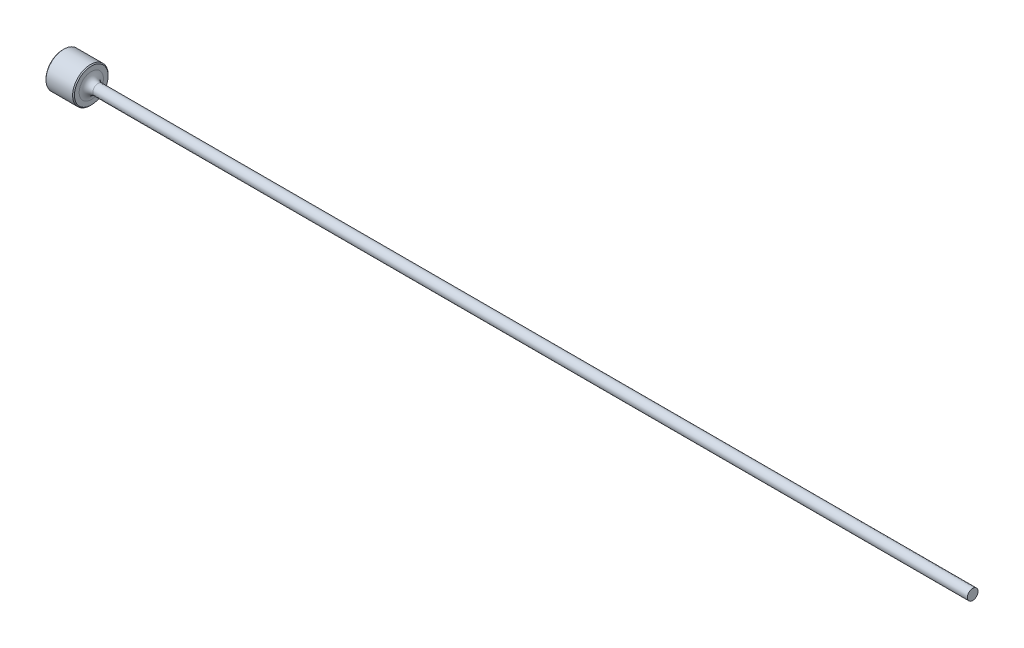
ISO-10303-21;
HEADER;
FILE_DESCRIPTION(('STEP AP214'),'2;1');
FILE_NAME('part.step','',(''),(''),'','','');
FILE_SCHEMA(('AUTOMOTIVE_DESIGN { 1 0 10303 214 1 1 1 1 }'));
ENDSEC;
DATA;
#1=APPLICATION_CONTEXT('core data for automotive mechanical design processes');
#2=APPLICATION_PROTOCOL_DEFINITION('international standard','automotive_design',2000,#1);
#3=PRODUCT_CONTEXT('',#1,'mechanical');
#4=PRODUCT('Part','Part','',(#3));
#5=PRODUCT_RELATED_PRODUCT_CATEGORY('part','',(#4));
#6=PRODUCT_DEFINITION_FORMATION('','',#4);
#7=PRODUCT_DEFINITION_CONTEXT('part definition',#1,'design');
#8=PRODUCT_DEFINITION('design','',#6,#7);
#9=PRODUCT_DEFINITION_SHAPE('','',#8);
#10=(LENGTH_UNIT() NAMED_UNIT(*) SI_UNIT(.MILLI.,.METRE.));
#11=(NAMED_UNIT(*) PLANE_ANGLE_UNIT() SI_UNIT($,.RADIAN.));
#12=(NAMED_UNIT(*) SI_UNIT($,.STERADIAN.) SOLID_ANGLE_UNIT());
#13=UNCERTAINTY_MEASURE_WITH_UNIT(LENGTH_MEASURE(1.E-05),#10,'distance_accuracy_value','');
#14=(GEOMETRIC_REPRESENTATION_CONTEXT(3) GLOBAL_UNCERTAINTY_ASSIGNED_CONTEXT((#13)) GLOBAL_UNIT_ASSIGNED_CONTEXT((#10,
#11,#12)) REPRESENTATION_CONTEXT('',''));
#15=CARTESIAN_POINT('',(0.,0.,0.));
#16=DIRECTION('',(0.,0.,1.));
#17=DIRECTION('',(1.,0.,0.));
#18=AXIS2_PLACEMENT_3D('',#15,#16,#17);
#19=CARTESIAN_POINT('',(101.6,0.591502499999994,0.));
#20=DIRECTION('',(1.,0.,0.));
#21=DIRECTION('',(0.,1.,0.));
#22=AXIS2_PLACEMENT_3D('',#19,#20,#21);
#23=PLANE('',#22);
#24=CARTESIAN_POINT('',(101.6,0.,0.));
#25=DIRECTION('',(1.,0.,0.));
#26=DIRECTION('',(0.,1.,0.));
#27=AXIS2_PLACEMENT_3D('',#24,#25,#26);
#28=CIRCLE('',#27,0.5915025);
#29=CARTESIAN_POINT('',(101.6,0.591502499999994,0.));
#30=VERTEX_POINT('',#29);
#31=EDGE_CURVE('E60',#30,#30,#28,.T.);
#32=ORIENTED_EDGE('',*,*,#31,.T.);
#33=EDGE_LOOP('',(#32));
#34=FACE_BOUND('',#33,.T.);
#35=ADVANCED_FACE('F34',(#34),#23,.T.);
#36=CARTESIAN_POINT('',(101.6,0.,0.));
#37=DIRECTION('',(1.,0.,0.));
#38=DIRECTION('',(0.,1.,0.));
#39=AXIS2_PLACEMENT_3D('',#36,#37,#38);
#40=CYLINDRICAL_SURFACE('',#39,0.591502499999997);
#41=CARTESIAN_POINT('',(3.937,0.,0.));
#42=DIRECTION('',(1.,0.,0.));
#43=DIRECTION('',(0.,1.,0.));
#44=AXIS2_PLACEMENT_3D('',#41,#42,#43);
#45=CIRCLE('',#44,0.591502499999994);
#46=CARTESIAN_POINT('',(3.937,0.591502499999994,0.));
#47=VERTEX_POINT('',#46);
#48=EDGE_CURVE('E64',#47,#47,#45,.T.);
#49=ORIENTED_EDGE('',*,*,#48,.T.);
#50=EDGE_LOOP('',(#49));
#51=FACE_BOUND('',#50,.T.);
#52=ORIENTED_EDGE('',*,*,#31,.F.);
#53=EDGE_LOOP('',(#52));
#54=FACE_BOUND('',#53,.T.);
#55=ADVANCED_FACE('F85',(#51,#54),#40,.T.);
#56=CARTESIAN_POINT('',(3.937,0.,0.));
#57=DIRECTION('',(1.,0.,0.));
#58=DIRECTION('',(0.,1.,0.));
#59=AXIS2_PLACEMENT_3D('',#56,#57,#58);
#60=TOROIDAL_SURFACE('',#59,1.35350249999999,0.762);
#61=CARTESIAN_POINT('',(3.175,0.,0.));
#62=DIRECTION('',(1.,0.,0.));
#63=DIRECTION('',(0.,1.,0.));
#64=AXIS2_PLACEMENT_3D('',#61,#62,#63);
#65=CIRCLE('',#64,1.35350249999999);
#66=CARTESIAN_POINT('',(3.175,1.35350249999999,0.));
#67=VERTEX_POINT('',#66);
#68=EDGE_CURVE('E67',#67,#67,#65,.T.);
#69=ORIENTED_EDGE('',*,*,#68,.T.);
#70=EDGE_LOOP('',(#69));
#71=FACE_BOUND('',#70,.T.);
#72=ORIENTED_EDGE('',*,*,#48,.F.);
#73=EDGE_LOOP('',(#72));
#74=FACE_BOUND('',#73,.T.);
#75=ADVANCED_FACE('F71',(#71,#74),#60,.F.);
#76=CARTESIAN_POINT('',(3.175,1.984375,0.));
#77=DIRECTION('',(1.,0.,0.));
#78=DIRECTION('',(0.,1.,0.));
#79=AXIS2_PLACEMENT_3D('',#76,#77,#78);
#80=PLANE('',#79);
#81=CARTESIAN_POINT('',(3.175,0.,0.));
#82=DIRECTION('',(1.,0.,0.));
#83=DIRECTION('',(0.,1.,0.));
#84=AXIS2_PLACEMENT_3D('',#81,#82,#83);
#85=CIRCLE('',#84,1.88277499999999);
#86=CARTESIAN_POINT('',(3.175,1.88277499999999,0.));
#87=VERTEX_POINT('',#86);
#88=EDGE_CURVE('E10',#87,#87,#85,.T.);
#89=ORIENTED_EDGE('',*,*,#88,.T.);
#90=EDGE_LOOP('',(#89));
#91=FACE_BOUND('',#90,.T.);
#92=ORIENTED_EDGE('',*,*,#68,.F.);
#93=EDGE_LOOP('',(#92));
#94=FACE_BOUND('',#93,.T.);
#95=ADVANCED_FACE('F74',(#91,#94),#80,.T.);
#96=CARTESIAN_POINT('',(101.6,0.,0.));
#97=DIRECTION('',(1.,0.,0.));
#98=DIRECTION('',(0.,1.,0.));
#99=AXIS2_PLACEMENT_3D('',#96,#97,#98);
#100=CYLINDRICAL_SURFACE('',#99,1.984375);
#101=CARTESIAN_POINT('',(0.101599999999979,0.,0.));
#102=DIRECTION('',(-1.,0.,0.));
#103=DIRECTION('',(0.,-1.,0.));
#104=AXIS2_PLACEMENT_3D('',#101,#102,#103);
#105=CIRCLE('',#104,1.984375);
#106=CARTESIAN_POINT('',(0.101599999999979,-1.984375,0.));
#107=VERTEX_POINT('',#106);
#108=EDGE_CURVE('E49',#107,#107,#105,.F.);
#109=ORIENTED_EDGE('',*,*,#108,.T.);
#110=EDGE_LOOP('',(#109));
#111=FACE_BOUND('',#110,.T.);
#112=CARTESIAN_POINT('',(3.07339999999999,0.,0.));
#113=DIRECTION('',(1.,0.,0.));
#114=DIRECTION('',(0.,1.,0.));
#115=AXIS2_PLACEMENT_3D('',#112,#113,#114);
#116=CIRCLE('',#115,1.984375);
#117=CARTESIAN_POINT('',(3.07339999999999,1.984375,0.));
#118=VERTEX_POINT('',#117);
#119=EDGE_CURVE('E54',#118,#118,#116,.F.);
#120=ORIENTED_EDGE('',*,*,#119,.T.);
#121=EDGE_LOOP('',(#120));
#122=FACE_BOUND('',#121,.T.);
#123=ADVANCED_FACE('F76',(#111,#122),#100,.T.);
#124=CARTESIAN_POINT('',(0.,0.,0.));
#125=DIRECTION('',(-1.,0.,0.));
#126=DIRECTION('',(0.,-1.,0.));
#127=AXIS2_PLACEMENT_3D('',#124,#125,#126);
#128=PLANE('',#127);
#129=CARTESIAN_POINT('',(0.,0.,0.));
#130=DIRECTION('',(-1.,0.,0.));
#131=DIRECTION('',(0.,-1.,0.));
#132=AXIS2_PLACEMENT_3D('',#129,#130,#131);
#133=CIRCLE('',#132,1.88277500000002);
#134=CARTESIAN_POINT('',(0.,-1.88277500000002,0.));
#135=VERTEX_POINT('',#134);
#136=EDGE_CURVE('E42',#135,#135,#133,.T.);
#137=ORIENTED_EDGE('',*,*,#136,.T.);
#138=EDGE_LOOP('',(#137));
#139=FACE_BOUND('',#138,.T.);
#140=ADVANCED_FACE('F82',(#139),#128,.T.);
#141=CARTESIAN_POINT('',(0.101599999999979,0.,0.));
#142=DIRECTION('',(1.,0.,0.));
#143=DIRECTION('',(0.,1.,0.));
#144=AXIS2_PLACEMENT_3D('',#141,#142,#143);
#145=CONICAL_SURFACE('',#144,1.984375,0.785398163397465);
#146=ORIENTED_EDGE('',*,*,#136,.F.);
#147=EDGE_LOOP('',(#146));
#148=FACE_BOUND('',#147,.T.);
#149=ORIENTED_EDGE('',*,*,#108,.F.);
#150=EDGE_LOOP('',(#149));
#151=FACE_BOUND('',#150,.T.);
#152=ADVANCED_FACE('F95',(#148,#151),#145,.T.);
#153=CARTESIAN_POINT('',(3.175,0.,0.));
#154=DIRECTION('',(-1.,0.,0.));
#155=DIRECTION('',(0.,-1.,0.));
#156=AXIS2_PLACEMENT_3D('',#153,#154,#155);
#157=CONICAL_SURFACE('',#156,1.88277499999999,0.785398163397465);
#158=ORIENTED_EDGE('',*,*,#119,.F.);
#159=EDGE_LOOP('',(#158));
#160=FACE_BOUND('',#159,.T.);
#161=ORIENTED_EDGE('',*,*,#88,.F.);
#162=EDGE_LOOP('',(#161));
#163=FACE_BOUND('',#162,.T.);
#164=ADVANCED_FACE('F36',(#160,#163),#157,.T.);
#165=CLOSED_SHELL('',(#35,#55,#75,#95,#123,#140,#152,#164));
#166=MANIFOLD_SOLID_BREP('B2',#165);
#167=ADVANCED_BREP_SHAPE_REPRESENTATION('',(#18,#166),#14);
#168=SHAPE_DEFINITION_REPRESENTATION(#9,#167);
ENDSEC;
END-ISO-10303-21;
